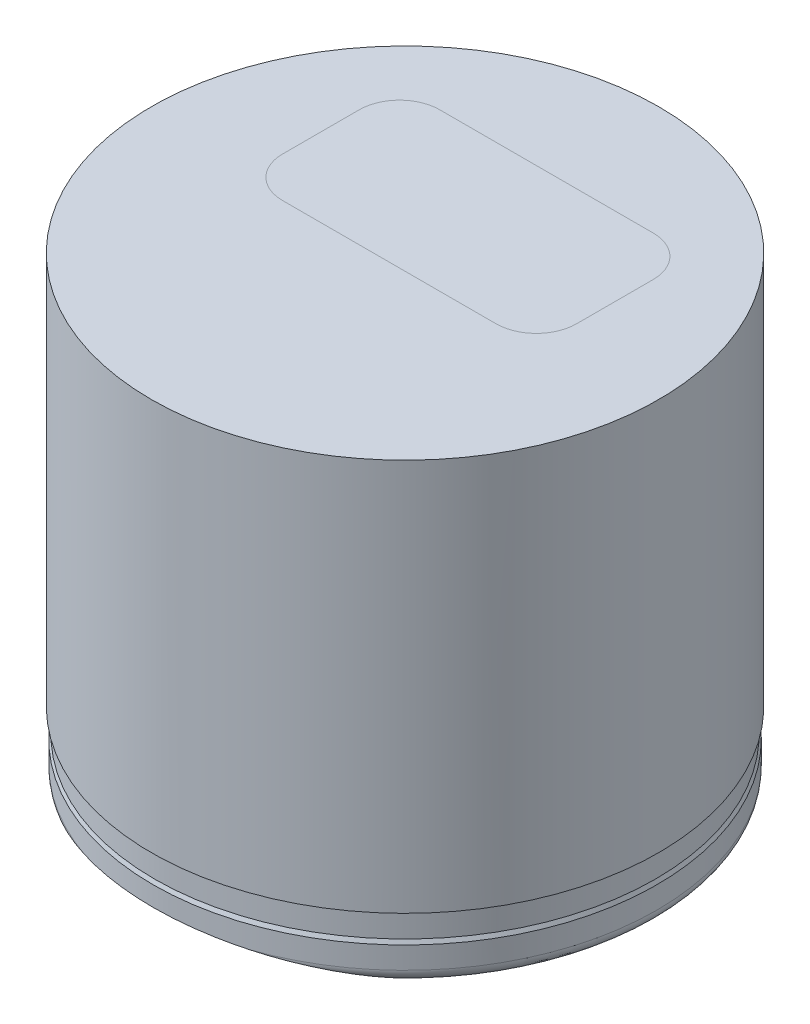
from build123d import *

# Parameters (mm, degrees)
SKETCH1_R           = 31.5214
EXTRUDE1_DEPTH      = 56.642
FILLET1_R           = 1.5875
EXTRUDE2_DEPTH      = 73.079910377
EXTRUDE2_DEPTH_BACK = 73.079910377
SKETCH8_RX          = 5.179136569
SKETCH8_RY          = 4.151416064
SKETCH8_RX_2        = 2.184866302
SKETCH8_RY_2        = 1.548121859
SKETCH8_RX_3        = 4.60448882
SKETCH8_RY_3        = 3.659569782
EXTRUDE3_DEPTH      = 0.0254


with BuildPart() as part:
    # Sketch1 → Extrude1 (new body)
    with BuildSketch(Plane(origin=(0, 0, 0), x_dir=(1, 0, 0), z_dir=(0, 1, 0))):
        with Locations(Location((0, 0, 0), (0, 0, 270))):
            Circle(SKETCH1_R)
    extrude(amount=EXTRUDE1_DEPTH)

    # Sketch7 → Cut-Revolve1 (revolve, cut)
    with BuildSketch(Plane.XY, mode=Mode.PRIVATE) as cut_revolve1_sk:
        Polygon((31.3055, -6.093184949), (31.3055, 4.318), (31.115, 4.826), (31.115, 7.874), (34.54220344, 7.874), (34.54220344, -6.093184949), align=None)
    revolve(cut_revolve1_sk.sketch.rotate(Axis((0, 0, 0), (0, -1, 0)), 90), axis=Axis((0, 0, 0), (0, -1, 0)), mode=Mode.SUBTRACT)

    # Fillet1
    fillet1_edges = [part.edges().sort_by_distance(p)[0] for p in [
        (0, 0, -31.3055),
    ]]
    fillet(fillet1_edges, radius=FILLET1_R)

    # Sketch6 → Extrude2 (cut, two sides: drawn at the far end of the back side and taken through both)
    with BuildSketch(Plane.ZY.offset(-EXTRUDE2_DEPTH_BACK)):
        Polygon((20.1295, 0), (31.3055, 1.8796), (31.3055, 0), align=None)
        Polygon((-20.1295, 0), (-31.3055, 1.8796), (-31.3055, 0), align=None)
    extrude(amount=EXTRUDE2_DEPTH + EXTRUDE2_DEPTH_BACK, mode=Mode.SUBTRACT)

    # Sketch8 → Extrude3 (cut)
    with BuildSketch(Plane.XZ):
        with Locations(Location((-18.912638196, 5.519090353), (0, 0, 90))):
            Ellipse(SKETCH8_RX, SKETCH8_RY)
        with Locations(Location((-18.912638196, -3.302142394), (0, 0, -90))):
            Ellipse(SKETCH8_RX_2, SKETCH8_RY_2)
        with BuildLine():
            add(Edge.make_bspline(
                [(-0.031825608, 12.695830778), (-3.627811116, 12.631136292), (-3.627811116, 7.646670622), (-3.627811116, 2.662204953), (-0.031825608, 2.639445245)],
                knots=[0.017545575, 0.017545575, 0.017545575, 1.579569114, 1.579569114, 3.141592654, 3.141592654, 3.141592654], degree=2, weights=[1, 0.710201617, 1, 0.710201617, 1]))
            Line((-0.031825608, 2.639445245), (-0.031825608, 12.695830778))
        make_face()
        with BuildLine():
            Line((-0.031825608, 12.695830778), (-0.031825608, 2.639445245))
            add(Edge.make_bspline(
                [(-0.031825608, 2.639445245), (3.595845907, 2.61648499), (3.627671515, 7.644863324), (3.659497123, 12.673241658), (0.031825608, 12.696201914)],
                knots=[3.141592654, 3.141592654, 3.141592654, 4.71238898, 4.71238898, 6.283185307, 6.283185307, 6.283185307], degree=2, weights=[1, 0.707106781, 1, 0.707106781, 1]))
            add(Edge.make_bspline(
                [(0.031825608, 12.696201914), (0, 12.696403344), (-0.031825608, 12.695830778)],
                knots=[0, 0, 0, 0.017545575, 0.017545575, 0.017545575], degree=2, weights=[1, 0.999961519, 1]))
        make_face()
        with BuildLine():
            add(Edge.make_bspline(
                [(-0.031825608, 12.695830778), (-3.627811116, 12.631136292), (-3.627811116, 7.646670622), (-3.627811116, 2.662204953), (-0.031825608, 2.639445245)],
                knots=[0.017545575, 0.017545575, 0.017545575, 1.579569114, 1.579569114, 3.141592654, 3.141592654, 3.141592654], degree=2, weights=[1, 0.710201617, 1, 0.710201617, 1]))
            Line((-0.031825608, 2.639445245), (-0.031825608, 12.695830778))
        make_face()
        with BuildLine():
            Line((-0.031825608, 12.695830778), (-0.031825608, 2.639445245))
            add(Edge.make_bspline(
                [(-0.031825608, 2.639445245), (3.595845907, 2.61648499), (3.627671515, 7.644863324), (3.659497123, 12.673241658), (0.031825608, 12.696201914)],
                knots=[3.141592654, 3.141592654, 3.141592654, 4.71238898, 4.71238898, 6.283185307, 6.283185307, 6.283185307], degree=2, weights=[1, 0.707106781, 1, 0.707106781, 1]))
            add(Edge.make_bspline(
                [(0.031825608, 12.696201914), (0, 12.696403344), (-0.031825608, 12.695830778)],
                knots=[0, 0, 0, 0.017545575, 0.017545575, 0.017545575], degree=2, weights=[1, 0.999961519, 1]))
        make_face()
        with Locations(Location((-0.031825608, -4.49422676), (0, 0, -90))):
            Ellipse(SKETCH8_RX_3, SKETCH8_RY_3)
        with Locations(Location((18.848986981, 5.519090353), (0, 0, 90))):
            Ellipse(SKETCH8_RX, SKETCH8_RY)
        with Locations(Location((18.848986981, -3.302142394), (0, 0, -90))):
            Ellipse(SKETCH8_RX_2, SKETCH8_RY_2)
    extrude(amount=-EXTRUDE3_DEPTH, mode=Mode.SUBTRACT)


solid = part.part
